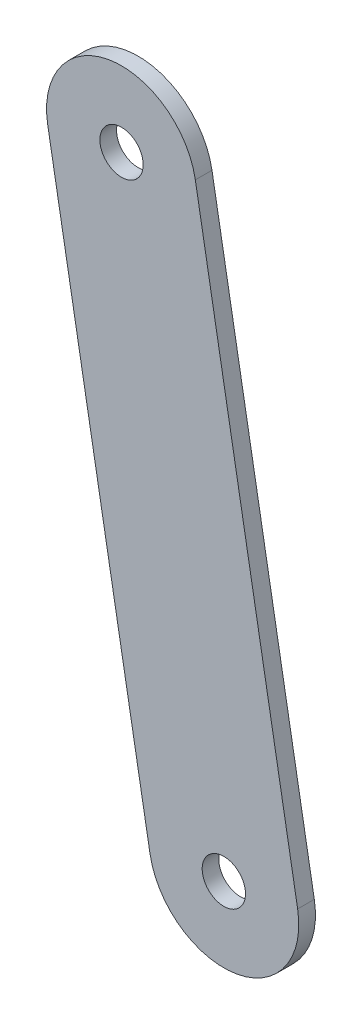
from build123d import *

# Parameters (mm, degrees)
SK_PLACA_JAULA_INTERIOR_R  = 2.6
PLACA_JAULA_INTERIOR_DEPTH = 2


with BuildPart() as part:
    # Sk_Placa_jaula_interior → Placa_jaula_interior (new body)
    with BuildSketch(Plane.XY.offset(-4.4)):
        with BuildLine():
            Line((-30.863269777, -69.562833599), (-18.577661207, -139.237982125))
            ThreePointArc((-18.577661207, -139.237982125), (-8.151557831, -146.538418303), (-0.851121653, -136.112314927))
            Line((-0.851121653, -136.112314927), (-13.136730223, -66.437166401))
            ThreePointArc((-13.136730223, -66.437166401), (-23.562833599, -59.136730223), (-30.863269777, -69.562833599))
        make_face()
        with Locations((-22, -68)):
            Circle(SK_PLACA_JAULA_INTERIOR_R, mode=Mode.SUBTRACT)
        with Locations((-9.71439143, -137.675148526)):
            Circle(SK_PLACA_JAULA_INTERIOR_R, mode=Mode.SUBTRACT)
    extrude(amount=PLACA_JAULA_INTERIOR_DEPTH)


solid = part.part
